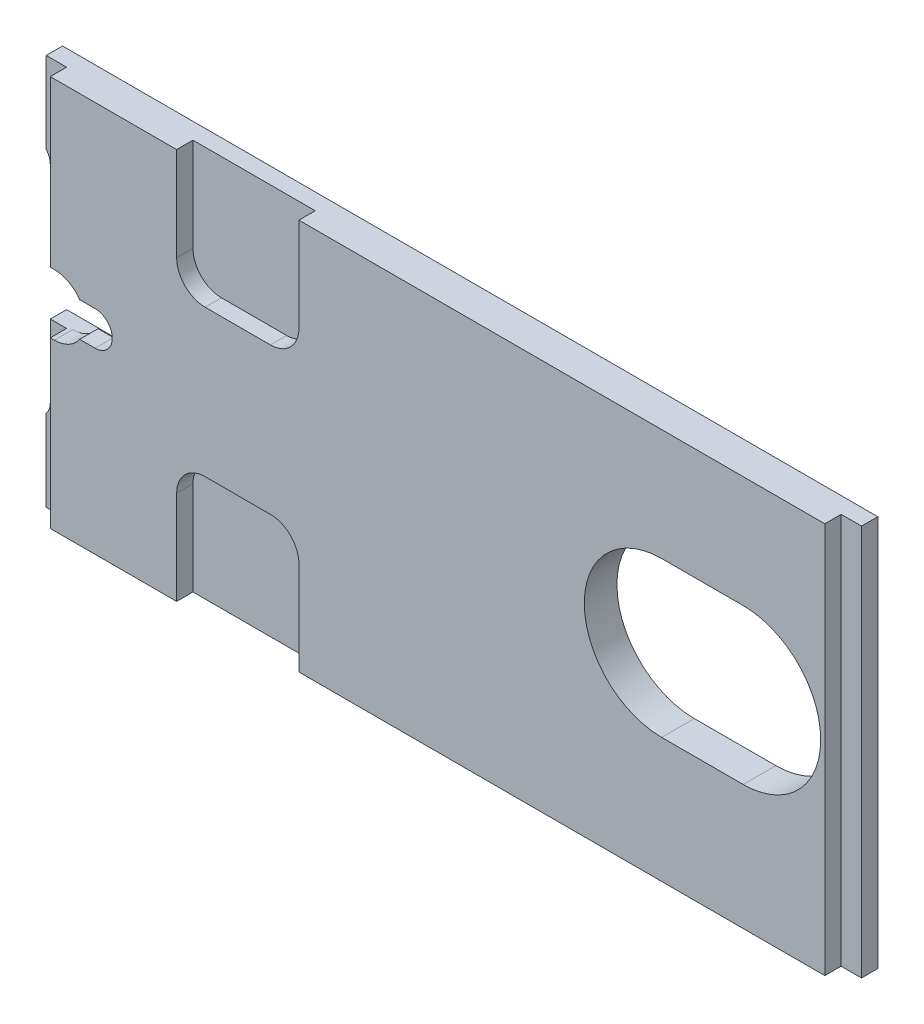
ISO-10303-21;
HEADER;
FILE_DESCRIPTION(('STEP AP214'),'2;1');
FILE_NAME('part.step','',(''),(''),'','','');
FILE_SCHEMA(('AUTOMOTIVE_DESIGN { 1 0 10303 214 1 1 1 1 }'));
ENDSEC;
DATA;
#1=APPLICATION_CONTEXT('core data for automotive mechanical design processes');
#2=APPLICATION_PROTOCOL_DEFINITION('international standard','automotive_design',2000,#1);
#3=PRODUCT_CONTEXT('',#1,'mechanical');
#4=PRODUCT('Part','Part','',(#3));
#5=PRODUCT_RELATED_PRODUCT_CATEGORY('part','',(#4));
#6=PRODUCT_DEFINITION_FORMATION('','',#4);
#7=PRODUCT_DEFINITION_CONTEXT('part definition',#1,'design');
#8=PRODUCT_DEFINITION('design','',#6,#7);
#9=PRODUCT_DEFINITION_SHAPE('','',#8);
#10=(LENGTH_UNIT() NAMED_UNIT(*) SI_UNIT(.MILLI.,.METRE.));
#11=(NAMED_UNIT(*) PLANE_ANGLE_UNIT() SI_UNIT($,.RADIAN.));
#12=(NAMED_UNIT(*) SI_UNIT($,.STERADIAN.) SOLID_ANGLE_UNIT());
#13=UNCERTAINTY_MEASURE_WITH_UNIT(LENGTH_MEASURE(1.E-05),#10,'distance_accuracy_value','');
#14=(GEOMETRIC_REPRESENTATION_CONTEXT(3) GLOBAL_UNCERTAINTY_ASSIGNED_CONTEXT((#13)) GLOBAL_UNIT_ASSIGNED_CONTEXT((#10,
#11,#12)) REPRESENTATION_CONTEXT('',''));
#15=CARTESIAN_POINT('',(0.,0.,0.));
#16=DIRECTION('',(0.,0.,1.));
#17=DIRECTION('',(1.,0.,0.));
#18=AXIS2_PLACEMENT_3D('',#15,#16,#17);
#19=CARTESIAN_POINT('',(-19.,25.354248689,0.));
#20=DIRECTION('',(0.,0.,1.));
#21=DIRECTION('',(1.,0.,0.));
#22=AXIS2_PLACEMENT_3D('',#19,#20,#21);
#23=CYLINDRICAL_SURFACE('',#22,4.);
#24=DIRECTION('',(0.,0.,1.));
#25=VECTOR('',#24,1.);
#26=CARTESIAN_POINT('',(-15.,25.354248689,2.));
#27=LINE('',#26,#25);
#28=CARTESIAN_POINT('',(-14.999999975,25.354248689,0.));
#29=VERTEX_POINT('',#28);
#30=CARTESIAN_POINT('',(-15.,25.354248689,4.));
#31=VERTEX_POINT('',#30);
#32=EDGE_CURVE('E621',#29,#31,#27,.T.);
#33=ORIENTED_EDGE('',*,*,#32,.T.);
#34=CARTESIAN_POINT('',(-19.,25.354248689,4.));
#35=DIRECTION('',(0.,0.,1.));
#36=DIRECTION('',(1.,0.,0.));
#37=AXIS2_PLACEMENT_3D('',#34,#35,#36);
#38=CIRCLE('',#37,4.);
#39=CARTESIAN_POINT('',(-16.,28.0000000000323,4.));
#40=VERTEX_POINT('',#39);
#41=EDGE_CURVE('E339',#31,#40,#38,.T.);
#42=ORIENTED_EDGE('',*,*,#41,.T.);
#43=DIRECTION('',(0.,0.,-1.));
#44=VECTOR('',#43,1.);
#45=CARTESIAN_POINT('',(-16.,28.,2.));
#46=LINE('',#45,#44);
#47=CARTESIAN_POINT('',(-16.,28.0000000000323,0.));
#48=VERTEX_POINT('',#47);
#49=EDGE_CURVE('E326',#40,#48,#46,.T.);
#50=ORIENTED_EDGE('',*,*,#49,.T.);
#51=CARTESIAN_POINT('',(-19.,25.354248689,0.));
#52=DIRECTION('',(0.,0.,1.));
#53=DIRECTION('',(1.,0.,0.));
#54=AXIS2_PLACEMENT_3D('',#51,#52,#53);
#55=CIRCLE('',#54,4.);
#56=EDGE_CURVE('E338',#29,#48,#55,.T.);
#57=ORIENTED_EDGE('',*,*,#56,.F.);
#58=EDGE_LOOP('',(#33,#42,#50,#57));
#59=FACE_BOUND('',#58,.T.);
#60=ADVANCED_FACE('F14',(#59),#23,.F.);
#61=CARTESIAN_POINT('',(-19.,-25.354248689,0.));
#62=DIRECTION('',(0.,0.,1.));
#63=DIRECTION('',(1.,0.,0.));
#64=AXIS2_PLACEMENT_3D('',#61,#62,#63);
#65=CYLINDRICAL_SURFACE('',#64,4.);
#66=DIRECTION('',(0.,0.,1.));
#67=VECTOR('',#66,1.);
#68=CARTESIAN_POINT('',(-16.,-28.,2.));
#69=LINE('',#68,#67);
#70=CARTESIAN_POINT('',(-16.,-28.0000000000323,0.));
#71=VERTEX_POINT('',#70);
#72=CARTESIAN_POINT('',(-16.,-28.0000000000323,4.));
#73=VERTEX_POINT('',#72);
#74=EDGE_CURVE('E333',#71,#73,#69,.T.);
#75=ORIENTED_EDGE('',*,*,#74,.T.);
#76=CARTESIAN_POINT('',(-19.,-25.354248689,4.));
#77=DIRECTION('',(0.,0.,1.));
#78=DIRECTION('',(1.,0.,0.));
#79=AXIS2_PLACEMENT_3D('',#76,#77,#78);
#80=CIRCLE('',#79,4.);
#81=CARTESIAN_POINT('',(-15.,-25.354248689,4.));
#82=VERTEX_POINT('',#81);
#83=EDGE_CURVE('E327',#73,#82,#80,.T.);
#84=ORIENTED_EDGE('',*,*,#83,.T.);
#85=DIRECTION('',(0.,0.,-1.));
#86=VECTOR('',#85,1.);
#87=CARTESIAN_POINT('',(-15.,-25.354248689,2.));
#88=LINE('',#87,#86);
#89=CARTESIAN_POINT('',(-14.999999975,-25.354248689,0.));
#90=VERTEX_POINT('',#89);
#91=EDGE_CURVE('E322',#82,#90,#88,.T.);
#92=ORIENTED_EDGE('',*,*,#91,.T.);
#93=CARTESIAN_POINT('',(-19.,-25.354248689,0.));
#94=DIRECTION('',(0.,0.,1.));
#95=DIRECTION('',(1.,0.,0.));
#96=AXIS2_PLACEMENT_3D('',#93,#94,#95);
#97=CIRCLE('',#96,4.);
#98=EDGE_CURVE('E356',#71,#90,#97,.T.);
#99=ORIENTED_EDGE('',*,*,#98,.F.);
#100=EDGE_LOOP('',(#75,#84,#92,#99));
#101=FACE_BOUND('',#100,.T.);
#102=ADVANCED_FACE('F741',(#101),#65,.F.);
#103=CARTESIAN_POINT('',(-15.,-7.5,4.));
#104=DIRECTION('',(1.,0.,0.));
#105=DIRECTION('',(0.,-1.,0.));
#106=AXIS2_PLACEMENT_3D('',#103,#104,#105);
#107=PLANE('',#106);
#108=ORIENTED_EDGE('',*,*,#91,.F.);
#109=DIRECTION('',(0.,1.,0.));
#110=VECTOR('',#109,1.);
#111=CARTESIAN_POINT('',(-15.,-27.75,4.));
#112=LINE('',#111,#110);
#113=CARTESIAN_POINT('',(-15.,-7.5,4.));
#114=VERTEX_POINT('',#113);
#115=EDGE_CURVE('E324',#82,#114,#112,.T.);
#116=ORIENTED_EDGE('',*,*,#115,.T.);
#117=DIRECTION('',(0.,0.,-1.));
#118=VECTOR('',#117,1.);
#119=CARTESIAN_POINT('',(-15.,-7.5,4.));
#120=LINE('',#119,#118);
#121=CARTESIAN_POINT('',(-14.9999999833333,-7.5,0.));
#122=VERTEX_POINT('',#121);
#123=EDGE_CURVE('E657',#114,#122,#120,.T.);
#124=ORIENTED_EDGE('',*,*,#123,.T.);
#125=DIRECTION('',(0.,1.,0.));
#126=VECTOR('',#125,1.);
#127=CARTESIAN_POINT('',(-14.99999995,0.,0.));
#128=LINE('',#127,#126);
#129=EDGE_CURVE('E351',#90,#122,#128,.T.);
#130=ORIENTED_EDGE('',*,*,#129,.F.);
#131=EDGE_LOOP('',(#108,#116,#124,#130));
#132=FACE_BOUND('',#131,.T.);
#133=ADVANCED_FACE('F744',(#132),#107,.F.);
#134=CARTESIAN_POINT('',(-15.,25.354248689,4.));
#135=DIRECTION('',(1.,0.,0.));
#136=DIRECTION('',(0.,-1.,0.));
#137=AXIS2_PLACEMENT_3D('',#134,#135,#136);
#138=PLANE('',#137);
#139=ORIENTED_EDGE('',*,*,#32,.F.);
#140=DIRECTION('',(0.,1.,0.));
#141=VECTOR('',#140,1.);
#142=CARTESIAN_POINT('',(-14.99999995,0.,0.));
#143=LINE('',#142,#141);
#144=CARTESIAN_POINT('',(-14.9999999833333,7.5,0.));
#145=VERTEX_POINT('',#144);
#146=EDGE_CURVE('E347',#145,#29,#143,.T.);
#147=ORIENTED_EDGE('',*,*,#146,.F.);
#148=DIRECTION('',(0.,0.,1.));
#149=VECTOR('',#148,1.);
#150=CARTESIAN_POINT('',(-15.,7.5,4.));
#151=LINE('',#150,#149);
#152=CARTESIAN_POINT('',(-15.,7.5,4.));
#153=VERTEX_POINT('',#152);
#154=EDGE_CURVE('E667',#145,#153,#151,.T.);
#155=ORIENTED_EDGE('',*,*,#154,.T.);
#156=DIRECTION('',(0.,1.,0.));
#157=VECTOR('',#156,1.);
#158=CARTESIAN_POINT('',(-15.,27.75,4.));
#159=LINE('',#158,#157);
#160=EDGE_CURVE('E342',#153,#31,#159,.T.);
#161=ORIENTED_EDGE('',*,*,#160,.T.);
#162=EDGE_LOOP('',(#139,#147,#155,#161));
#163=FACE_BOUND('',#162,.T.);
#164=ADVANCED_FACE('F638',(#163),#138,.F.);
#165=CARTESIAN_POINT('',(-16.,-48.,4.));
#166=DIRECTION('',(1.,0.,0.));
#167=DIRECTION('',(0.,0.,-1.));
#168=AXIS2_PLACEMENT_3D('',#165,#166,#167);
#169=PLANE('',#168);
#170=ORIENTED_EDGE('',*,*,#74,.F.);
#171=DIRECTION('',(0.,1.,0.));
#172=VECTOR('',#171,1.);
#173=CARTESIAN_POINT('',(-16.,0.,0.));
#174=LINE('',#173,#172);
#175=CARTESIAN_POINT('',(-16.,-48.,0.));
#176=VERTEX_POINT('',#175);
#177=EDGE_CURVE('E359',#176,#71,#174,.T.);
#178=ORIENTED_EDGE('',*,*,#177,.F.);
#179=DIRECTION('',(0.,0.,1.));
#180=VECTOR('',#179,1.);
#181=CARTESIAN_POINT('',(-16.,-48.,4.));
#182=LINE('',#181,#180);
#183=CARTESIAN_POINT('',(-16.,-48.,4.));
#184=VERTEX_POINT('',#183);
#185=EDGE_CURVE('E571',#176,#184,#182,.T.);
#186=ORIENTED_EDGE('',*,*,#185,.T.);
#187=DIRECTION('',(0.,1.,0.));
#188=VECTOR('',#187,1.);
#189=CARTESIAN_POINT('',(-16.,-27.75,4.));
#190=LINE('',#189,#188);
#191=EDGE_CURVE('E330',#184,#73,#190,.T.);
#192=ORIENTED_EDGE('',*,*,#191,.T.);
#193=EDGE_LOOP('',(#170,#178,#186,#192));
#194=FACE_BOUND('',#193,.T.);
#195=ADVANCED_FACE('F728',(#194),#169,.F.);
#196=CARTESIAN_POINT('',(20.,-48.,4.));
#197=DIRECTION('',(0.,0.,-1.));
#198=DIRECTION('',(0.,1.,0.));
#199=AXIS2_PLACEMENT_3D('',#196,#197,#198);
#200=PLANE('',#199);
#201=DIRECTION('',(0.,1.,0.));
#202=VECTOR('',#201,1.);
#203=CARTESIAN_POINT('',(50.,-36.5,4.));
#204=LINE('',#203,#202);
#205=CARTESIAN_POINT('',(49.9999999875,-48.,4.));
#206=VERTEX_POINT('',#205);
#207=CARTESIAN_POINT('',(50.,-24.9999999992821,4.));
#208=VERTEX_POINT('',#207);
#209=EDGE_CURVE('E607',#206,#208,#204,.T.);
#210=ORIENTED_EDGE('',*,*,#209,.T.);
#211=CARTESIAN_POINT('',(43.,-25.,4.));
#212=DIRECTION('',(0.,0.,1.));
#213=DIRECTION('',(1.,0.,0.));
#214=AXIS2_PLACEMENT_3D('',#211,#212,#213);
#215=CIRCLE('',#214,7.);
#216=CARTESIAN_POINT('',(43.,-18.,4.));
#217=VERTEX_POINT('',#216);
#218=EDGE_CURVE('E498',#217,#208,#215,.F.);
#219=ORIENTED_EDGE('',*,*,#218,.F.);
#220=DIRECTION('',(-1.,0.,0.));
#221=VECTOR('',#220,1.);
#222=CARTESIAN_POINT('',(35.,-18.,4.));
#223=LINE('',#222,#221);
#224=CARTESIAN_POINT('',(26.9999999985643,-18.,4.));
#225=VERTEX_POINT('',#224);
#226=EDGE_CURVE('E495',#217,#225,#223,.T.);
#227=ORIENTED_EDGE('',*,*,#226,.T.);
#228=CARTESIAN_POINT('',(27.,-25.,4.));
#229=DIRECTION('',(0.,0.,1.));
#230=DIRECTION('',(1.,0.,0.));
#231=AXIS2_PLACEMENT_3D('',#228,#229,#230);
#232=CIRCLE('',#231,7.);
#233=CARTESIAN_POINT('',(20.,-25.,4.));
#234=VERTEX_POINT('',#233);
#235=EDGE_CURVE('E491',#234,#225,#232,.F.);
#236=ORIENTED_EDGE('',*,*,#235,.F.);
#237=DIRECTION('',(0.,-1.,0.));
#238=VECTOR('',#237,1.);
#239=CARTESIAN_POINT('',(20.,-36.5,4.));
#240=LINE('',#239,#238);
#241=CARTESIAN_POINT('',(20.000000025,-48.,4.));
#242=VERTEX_POINT('',#241);
#243=EDGE_CURVE('E476',#234,#242,#240,.T.);
#244=ORIENTED_EDGE('',*,*,#243,.T.);
#245=DIRECTION('',(1.,0.,0.));
#246=VECTOR('',#245,1.);
#247=CARTESIAN_POINT('',(71.5,-48.,4.));
#248=LINE('',#247,#246);
#249=EDGE_CURVE('E481',#242,#206,#248,.T.);
#250=ORIENTED_EDGE('',*,*,#249,.T.);
#251=EDGE_LOOP('',(#210,#219,#227,#236,#244,#250));
#252=FACE_BOUND('',#251,.T.);
#253=ADVANCED_FACE('F1028',(#252),#200,.F.);
#254=CARTESIAN_POINT('',(-16.,-48.,4.));
#255=DIRECTION('',(0.,0.,-1.));
#256=DIRECTION('',(0.,1.,0.));
#257=AXIS2_PLACEMENT_3D('',#254,#255,#256);
#258=PLANE('',#257);
#259=ORIENTED_EDGE('',*,*,#115,.F.);
#260=ORIENTED_EDGE('',*,*,#83,.F.);
#261=ORIENTED_EDGE('',*,*,#191,.F.);
#262=DIRECTION('',(1.,0.,0.));
#263=VECTOR('',#262,1.);
#264=CARTESIAN_POINT('',(71.5,-48.,4.));
#265=LINE('',#264,#263);
#266=CARTESIAN_POINT('',(-10.9999999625,-48.,4.));
#267=VERTEX_POINT('',#266);
#268=EDGE_CURVE('E482',#184,#267,#265,.T.);
#269=ORIENTED_EDGE('',*,*,#268,.T.);
#270=DIRECTION('',(0.,1.,0.));
#271=VECTOR('',#270,1.);
#272=CARTESIAN_POINT('',(-11.,-27.75,4.));
#273=LINE('',#272,#271);
#274=CARTESIAN_POINT('',(-10.9999999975,-7.5,4.));
#275=VERTEX_POINT('',#274);
#276=EDGE_CURVE('E372',#267,#275,#273,.T.);
#277=ORIENTED_EDGE('',*,*,#276,.T.);
#278=DIRECTION('',(-1.,0.,0.));
#279=VECTOR('',#278,1.);
#280=CARTESIAN_POINT('',(-7.5,-7.5,4.));
#281=LINE('',#280,#279);
#282=EDGE_CURVE('E537',#275,#114,#281,.T.);
#283=ORIENTED_EDGE('',*,*,#282,.T.);
#284=EDGE_LOOP('',(#259,#260,#261,#269,#277,#283));
#285=FACE_BOUND('',#284,.T.);
#286=ADVANCED_FACE('F736',(#285),#258,.F.);
#287=CARTESIAN_POINT('',(-16.,28.,4.));
#288=DIRECTION('',(1.,0.,0.));
#289=DIRECTION('',(0.,0.,-1.));
#290=AXIS2_PLACEMENT_3D('',#287,#288,#289);
#291=PLANE('',#290);
#292=ORIENTED_EDGE('',*,*,#49,.F.);
#293=DIRECTION('',(0.,1.,0.));
#294=VECTOR('',#293,1.);
#295=CARTESIAN_POINT('',(-16.,27.75,4.));
#296=LINE('',#295,#294);
#297=CARTESIAN_POINT('',(-16.,48.,4.));
#298=VERTEX_POINT('',#297);
#299=EDGE_CURVE('E336',#40,#298,#296,.T.);
#300=ORIENTED_EDGE('',*,*,#299,.T.);
#301=DIRECTION('',(0.,0.,1.));
#302=VECTOR('',#301,1.);
#303=CARTESIAN_POINT('',(-16.,48.,4.));
#304=LINE('',#303,#302);
#305=CARTESIAN_POINT('',(-16.,48.,0.));
#306=VERTEX_POINT('',#305);
#307=EDGE_CURVE('E555',#306,#298,#304,.T.);
#308=ORIENTED_EDGE('',*,*,#307,.F.);
#309=DIRECTION('',(0.,1.,0.));
#310=VECTOR('',#309,1.);
#311=CARTESIAN_POINT('',(-16.,0.,0.));
#312=LINE('',#311,#310);
#313=EDGE_CURVE('E362',#48,#306,#312,.T.);
#314=ORIENTED_EDGE('',*,*,#313,.F.);
#315=EDGE_LOOP('',(#292,#300,#308,#314));
#316=FACE_BOUND('',#315,.T.);
#317=ADVANCED_FACE('F626',(#316),#291,.F.);
#318=CARTESIAN_POINT('',(-16.,7.5,4.));
#319=DIRECTION('',(0.,0.,-1.));
#320=DIRECTION('',(0.,1.,0.));
#321=AXIS2_PLACEMENT_3D('',#318,#319,#320);
#322=PLANE('',#321);
#323=ORIENTED_EDGE('',*,*,#41,.F.);
#324=ORIENTED_EDGE('',*,*,#160,.F.);
#325=DIRECTION('',(1.,0.,0.));
#326=VECTOR('',#325,1.);
#327=CARTESIAN_POINT('',(-7.5,7.5,4.));
#328=LINE('',#327,#326);
#329=CARTESIAN_POINT('',(-10.9999999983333,7.5,4.));
#330=VERTEX_POINT('',#329);
#331=EDGE_CURVE('E545',#153,#330,#328,.T.);
#332=ORIENTED_EDGE('',*,*,#331,.T.);
#333=DIRECTION('',(0.,1.,0.));
#334=VECTOR('',#333,1.);
#335=CARTESIAN_POINT('',(-11.,27.75,4.));
#336=LINE('',#335,#334);
#337=CARTESIAN_POINT('',(-10.99999995,48.,4.));
#338=VERTEX_POINT('',#337);
#339=EDGE_CURVE('E465',#330,#338,#336,.T.);
#340=ORIENTED_EDGE('',*,*,#339,.T.);
#341=DIRECTION('',(1.,0.,0.));
#342=VECTOR('',#341,1.);
#343=CARTESIAN_POINT('',(71.5,48.,4.));
#344=LINE('',#343,#342);
#345=EDGE_CURVE('E455',#298,#338,#344,.T.);
#346=ORIENTED_EDGE('',*,*,#345,.F.);
#347=ORIENTED_EDGE('',*,*,#299,.F.);
#348=EDGE_LOOP('',(#323,#324,#332,#340,#346,#347));
#349=FACE_BOUND('',#348,.T.);
#350=ADVANCED_FACE('F629',(#349),#322,.F.);
#351=CARTESIAN_POINT('',(20.,48.,4.));
#352=DIRECTION('',(0.,0.,1.));
#353=DIRECTION('',(0.,-1.,0.));
#354=AXIS2_PLACEMENT_3D('',#351,#352,#353);
#355=PLANE('',#354);
#356=DIRECTION('',(1.,0.,0.));
#357=VECTOR('',#356,1.);
#358=CARTESIAN_POINT('',(71.5,48.,4.));
#359=LINE('',#358,#357);
#360=CARTESIAN_POINT('',(20.0000000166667,48.,4.));
#361=VERTEX_POINT('',#360);
#362=CARTESIAN_POINT('',(49.9999999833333,48.,4.));
#363=VERTEX_POINT('',#362);
#364=EDGE_CURVE('E513',#361,#363,#359,.T.);
#365=ORIENTED_EDGE('',*,*,#364,.F.);
#366=DIRECTION('',(0.,-1.,0.));
#367=VECTOR('',#366,1.);
#368=CARTESIAN_POINT('',(20.,36.5,4.));
#369=LINE('',#368,#367);
#370=CARTESIAN_POINT('',(20.,25.0000000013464,4.));
#371=VERTEX_POINT('',#370);
#372=EDGE_CURVE('E442',#361,#371,#369,.T.);
#373=ORIENTED_EDGE('',*,*,#372,.T.);
#374=CARTESIAN_POINT('',(27.,25.,4.));
#375=DIRECTION('',(0.,0.,1.));
#376=DIRECTION('',(1.,0.,0.));
#377=AXIS2_PLACEMENT_3D('',#374,#375,#376);
#378=CIRCLE('',#377,7.);
#379=CARTESIAN_POINT('',(26.9999999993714,18.,4.));
#380=VERTEX_POINT('',#379);
#381=EDGE_CURVE('E438',#380,#371,#378,.F.);
#382=ORIENTED_EDGE('',*,*,#381,.F.);
#383=DIRECTION('',(1.,0.,0.));
#384=VECTOR('',#383,1.);
#385=CARTESIAN_POINT('',(35.,18.,4.));
#386=LINE('',#385,#384);
#387=CARTESIAN_POINT('',(43.,18.,4.));
#388=VERTEX_POINT('',#387);
#389=EDGE_CURVE('E543',#380,#388,#386,.T.);
#390=ORIENTED_EDGE('',*,*,#389,.T.);
#391=CARTESIAN_POINT('',(43.,25.,4.));
#392=DIRECTION('',(0.,0.,1.));
#393=DIRECTION('',(1.,0.,0.));
#394=AXIS2_PLACEMENT_3D('',#391,#392,#393);
#395=CIRCLE('',#394,7.);
#396=CARTESIAN_POINT('',(50.,25.,4.));
#397=VERTEX_POINT('',#396);
#398=EDGE_CURVE('E523',#397,#388,#395,.F.);
#399=ORIENTED_EDGE('',*,*,#398,.F.);
#400=DIRECTION('',(0.,1.,0.));
#401=VECTOR('',#400,1.);
#402=CARTESIAN_POINT('',(50.,36.5,4.));
#403=LINE('',#402,#401);
#404=EDGE_CURVE('E519',#397,#363,#403,.T.);
#405=ORIENTED_EDGE('',*,*,#404,.T.);
#406=EDGE_LOOP('',(#365,#373,#382,#390,#399,#405));
#407=FACE_BOUND('',#406,.T.);
#408=ADVANCED_FACE('F710',(#407),#355,.T.);
#409=CARTESIAN_POINT('',(-16.,-48.,0.));
#410=DIRECTION('',(0.,0.,-1.));
#411=DIRECTION('',(0.,1.,0.));
#412=AXIS2_PLACEMENT_3D('',#409,#410,#411);
#413=PLANE('',#412);
#414=CARTESIAN_POINT('',(159.,1.60748590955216,0.));
#415=DIRECTION('',(0.,0.,-1.));
#416=DIRECTION('',(-1.,0.,0.));
#417=AXIS2_PLACEMENT_3D('',#414,#415,#416);
#418=CIRCLE('',#417,19.);
#419=CARTESIAN_POINT('',(159.,20.6074859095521,0.));
#420=VERTEX_POINT('',#419);
#421=CARTESIAN_POINT('',(159.,-17.3925140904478,0.));
#422=VERTEX_POINT('',#421);
#423=EDGE_CURVE('E38',#420,#422,#418,.T.);
#424=ORIENTED_EDGE('',*,*,#423,.F.);
#425=DIRECTION('',(1.,0.,0.));
#426=VECTOR('',#425,1.);
#427=CARTESIAN_POINT('',(159.,20.6074859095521,0.));
#428=LINE('',#427,#426);
#429=CARTESIAN_POINT('',(139.,20.6074859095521,0.));
#430=VERTEX_POINT('',#429);
#431=EDGE_CURVE('E305',#430,#420,#428,.T.);
#432=ORIENTED_EDGE('',*,*,#431,.F.);
#433=CARTESIAN_POINT('',(139.,1.60748590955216,0.));
#434=DIRECTION('',(0.,0.,-1.));
#435=DIRECTION('',(-1.,0.,0.));
#436=AXIS2_PLACEMENT_3D('',#433,#434,#435);
#437=CIRCLE('',#436,19.);
#438=CARTESIAN_POINT('',(139.,-17.3925140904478,0.));
#439=VERTEX_POINT('',#438);
#440=EDGE_CURVE('E302',#439,#430,#437,.T.);
#441=ORIENTED_EDGE('',*,*,#440,.F.);
#442=DIRECTION('',(-1.,0.,0.));
#443=VECTOR('',#442,1.);
#444=CARTESIAN_POINT('',(139.,-17.3925140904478,0.));
#445=LINE('',#444,#443);
#446=EDGE_CURVE('E299',#422,#439,#445,.T.);
#447=ORIENTED_EDGE('',*,*,#446,.F.);
#448=EDGE_LOOP('',(#424,#432,#441,#447));
#449=FACE_BOUND('',#448,.T.);
#450=ORIENTED_EDGE('',*,*,#313,.T.);
#451=DIRECTION('',(-1.,0.,0.));
#452=VECTOR('',#451,1.);
#453=CARTESIAN_POINT('',(71.5,48.,0.));
#454=LINE('',#453,#452);
#455=CARTESIAN_POINT('',(184.,48.,0.));
#456=VERTEX_POINT('',#455);
#457=EDGE_CURVE('E512',#456,#306,#454,.T.);
#458=ORIENTED_EDGE('',*,*,#457,.F.);
#459=DIRECTION('',(0.,-1.,0.));
#460=VECTOR('',#459,1.);
#461=CARTESIAN_POINT('',(184.,48.,0.));
#462=LINE('',#461,#460);
#463=CARTESIAN_POINT('',(184.,-48.,0.));
#464=VERTEX_POINT('',#463);
#465=EDGE_CURVE('E311',#456,#464,#462,.T.);
#466=ORIENTED_EDGE('',*,*,#465,.T.);
#467=DIRECTION('',(-1.,0.,0.));
#468=VECTOR('',#467,1.);
#469=CARTESIAN_POINT('',(71.5,-48.,0.));
#470=LINE('',#469,#468);
#471=EDGE_CURVE('E504',#464,#176,#470,.T.);
#472=ORIENTED_EDGE('',*,*,#471,.T.);
#473=ORIENTED_EDGE('',*,*,#177,.T.);
#474=ORIENTED_EDGE('',*,*,#98,.T.);
#475=ORIENTED_EDGE('',*,*,#129,.T.);
#476=DIRECTION('',(1.,0.,0.));
#477=VECTOR('',#476,1.);
#478=CARTESIAN_POINT('',(-7.5,-7.5,0.));
#479=LINE('',#478,#477);
#480=CARTESIAN_POINT('',(-1.53825216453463E-09,-7.5,0.));
#481=VERTEX_POINT('',#480);
#482=EDGE_CURVE('E612',#122,#481,#479,.T.);
#483=ORIENTED_EDGE('',*,*,#482,.T.);
#484=CARTESIAN_POINT('',(0.,0.,0.));
#485=DIRECTION('',(0.,0.,-1.));
#486=DIRECTION('',(-1.,0.,0.));
#487=AXIS2_PLACEMENT_3D('',#484,#485,#486);
#488=CIRCLE('',#487,7.5);
#489=CARTESIAN_POINT('',(0.,7.5,0.));
#490=VERTEX_POINT('',#489);
#491=EDGE_CURVE('E535',#490,#481,#488,.T.);
#492=ORIENTED_EDGE('',*,*,#491,.F.);
#493=DIRECTION('',(-1.,0.,0.));
#494=VECTOR('',#493,1.);
#495=CARTESIAN_POINT('',(-7.5,7.5,0.));
#496=LINE('',#495,#494);
#497=EDGE_CURVE('E532',#490,#145,#496,.T.);
#498=ORIENTED_EDGE('',*,*,#497,.T.);
#499=ORIENTED_EDGE('',*,*,#146,.T.);
#500=ORIENTED_EDGE('',*,*,#56,.T.);
#501=EDGE_LOOP('',(#450,#458,#466,#472,#473,#474,#475,#483,#492,#498,#499,#500));
#502=FACE_BOUND('',#501,.T.);
#503=ADVANCED_FACE('F635',(#449,#502),#413,.T.);
#504=CARTESIAN_POINT('',(-15.,-7.5,8.));
#505=DIRECTION('',(0.,-1.,0.));
#506=DIRECTION('',(0.,0.,-1.));
#507=AXIS2_PLACEMENT_3D('',#504,#505,#506);
#508=PLANE('',#507);
#509=ORIENTED_EDGE('',*,*,#123,.F.);
#510=ORIENTED_EDGE('',*,*,#282,.F.);
#511=DIRECTION('',(0.,0.,1.));
#512=VECTOR('',#511,1.);
#513=CARTESIAN_POINT('',(-11.,-7.5,6.));
#514=LINE('',#513,#512);
#515=CARTESIAN_POINT('',(-10.9999999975,-7.5,8.));
#516=VERTEX_POINT('',#515);
#517=EDGE_CURVE('E373',#275,#516,#514,.T.);
#518=ORIENTED_EDGE('',*,*,#517,.T.);
#519=DIRECTION('',(-1.,0.,0.));
#520=VECTOR('',#519,1.);
#521=CARTESIAN_POINT('',(-7.5,-7.5,8.));
#522=LINE('',#521,#520);
#523=CARTESIAN_POINT('',(-10.0000000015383,-7.5,8.));
#524=VERTEX_POINT('',#523);
#525=EDGE_CURVE('E350',#524,#516,#522,.T.);
#526=ORIENTED_EDGE('',*,*,#525,.F.);
#527=DIRECTION('',(0.,0.,-1.));
#528=VECTOR('',#527,1.);
#529=CARTESIAN_POINT('',(-10.0000000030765,-7.5,5.75));
#530=LINE('',#529,#528);
#531=CARTESIAN_POINT('',(-10.0000000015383,-7.5,3.5));
#532=VERTEX_POINT('',#531);
#533=EDGE_CURVE('E381',#532,#524,#530,.F.);
#534=ORIENTED_EDGE('',*,*,#533,.F.);
#535=DIRECTION('',(1.,0.,0.));
#536=VECTOR('',#535,1.);
#537=CARTESIAN_POINT('',(-1.25,-7.5,3.5));
#538=LINE('',#537,#536);
#539=CARTESIAN_POINT('',(-1.53825216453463E-09,-7.5,3.5));
#540=VERTEX_POINT('',#539);
#541=EDGE_CURVE('E379',#532,#540,#538,.T.);
#542=ORIENTED_EDGE('',*,*,#541,.T.);
#543=DIRECTION('',(0.,0.,-1.));
#544=VECTOR('',#543,1.);
#545=CARTESIAN_POINT('',(-3.07654943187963E-09,-7.5,1.75));
#546=LINE('',#545,#544);
#547=EDGE_CURVE('E527',#481,#540,#546,.F.);
#548=ORIENTED_EDGE('',*,*,#547,.F.);
#549=ORIENTED_EDGE('',*,*,#482,.F.);
#550=EDGE_LOOP('',(#509,#510,#518,#526,#534,#542,#548,#549));
#551=FACE_BOUND('',#550,.T.);
#552=ADVANCED_FACE('F749',(#551),#508,.F.);
#553=CARTESIAN_POINT('',(0.,0.,3.5));
#554=DIRECTION('',(0.,0.,-1.));
#555=DIRECTION('',(-1.,0.,0.));
#556=AXIS2_PLACEMENT_3D('',#553,#554,#555);
#557=CYLINDRICAL_SURFACE('',#556,7.5);
#558=ORIENTED_EDGE('',*,*,#547,.T.);
#559=CARTESIAN_POINT('',(0.,0.,3.5));
#560=DIRECTION('',(0.,0.,-1.));
#561=DIRECTION('',(-1.,0.,0.));
#562=AXIS2_PLACEMENT_3D('',#559,#560,#561);
#563=CIRCLE('',#562,7.5);
#564=CARTESIAN_POINT('',(0.,7.5,3.5));
#565=VERTEX_POINT('',#564);
#566=EDGE_CURVE('E378',#540,#565,#563,.F.);
#567=ORIENTED_EDGE('',*,*,#566,.T.);
#568=DIRECTION('',(0.,0.,-1.));
#569=VECTOR('',#568,1.);
#570=CARTESIAN_POINT('',(0.,7.5,4.));
#571=LINE('',#570,#569);
#572=EDGE_CURVE('E526',#565,#490,#571,.T.);
#573=ORIENTED_EDGE('',*,*,#572,.T.);
#574=ORIENTED_EDGE('',*,*,#491,.T.);
#575=EDGE_LOOP('',(#558,#567,#573,#574));
#576=FACE_BOUND('',#575,.T.);
#577=ADVANCED_FACE('F753',(#576),#557,.F.);
#578=CARTESIAN_POINT('',(-15.,7.5,0.));
#579=DIRECTION('',(0.,1.,0.));
#580=DIRECTION('',(0.,0.,1.));
#581=AXIS2_PLACEMENT_3D('',#578,#579,#580);
#582=PLANE('',#581);
#583=ORIENTED_EDGE('',*,*,#154,.F.);
#584=ORIENTED_EDGE('',*,*,#497,.F.);
#585=ORIENTED_EDGE('',*,*,#572,.F.);
#586=DIRECTION('',(-1.,0.,0.));
#587=VECTOR('',#586,1.);
#588=CARTESIAN_POINT('',(-1.25,7.5,3.5));
#589=LINE('',#588,#587);
#590=CARTESIAN_POINT('',(-10.,7.5,3.5));
#591=VERTEX_POINT('',#590);
#592=EDGE_CURVE('E374',#565,#591,#589,.T.);
#593=ORIENTED_EDGE('',*,*,#592,.T.);
#594=DIRECTION('',(0.,0.,1.));
#595=VECTOR('',#594,1.);
#596=CARTESIAN_POINT('',(-10.,7.5,5.75));
#597=LINE('',#596,#595);
#598=CARTESIAN_POINT('',(-10.,7.5,8.));
#599=VERTEX_POINT('',#598);
#600=EDGE_CURVE('E468',#599,#591,#597,.F.);
#601=ORIENTED_EDGE('',*,*,#600,.F.);
#602=DIRECTION('',(1.,0.,0.));
#603=VECTOR('',#602,1.);
#604=CARTESIAN_POINT('',(-7.5,7.5,8.));
#605=LINE('',#604,#603);
#606=CARTESIAN_POINT('',(-10.9999999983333,7.5,8.));
#607=VERTEX_POINT('',#606);
#608=EDGE_CURVE('E524',#607,#599,#605,.T.);
#609=ORIENTED_EDGE('',*,*,#608,.F.);
#610=DIRECTION('',(0.,0.,-1.));
#611=VECTOR('',#610,1.);
#612=CARTESIAN_POINT('',(-11.,7.5,6.));
#613=LINE('',#612,#611);
#614=EDGE_CURVE('E462',#607,#330,#613,.T.);
#615=ORIENTED_EDGE('',*,*,#614,.T.);
#616=ORIENTED_EDGE('',*,*,#331,.F.);
#617=EDGE_LOOP('',(#583,#584,#585,#593,#601,#609,#615,#616));
#618=FACE_BOUND('',#617,.T.);
#619=ADVANCED_FACE('F689',(#618),#582,.F.);
#620=CARTESIAN_POINT('',(27.,18.,8.));
#621=DIRECTION('',(0.,-1.,0.));
#622=DIRECTION('',(0.,0.,-1.));
#623=AXIS2_PLACEMENT_3D('',#620,#621,#622);
#624=PLANE('',#623);
#625=DIRECTION('',(0.,0.,-1.));
#626=VECTOR('',#625,1.);
#627=CARTESIAN_POINT('',(43.,18.,6.));
#628=LINE('',#627,#626);
#629=CARTESIAN_POINT('',(43.,18.,8.));
#630=VERTEX_POINT('',#629);
#631=EDGE_CURVE('E520',#388,#630,#628,.F.);
#632=ORIENTED_EDGE('',*,*,#631,.F.);
#633=ORIENTED_EDGE('',*,*,#389,.F.);
#634=DIRECTION('',(0.,0.,1.));
#635=VECTOR('',#634,1.);
#636=CARTESIAN_POINT('',(26.9999999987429,18.,6.));
#637=LINE('',#636,#635);
#638=CARTESIAN_POINT('',(26.9999999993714,18.,8.));
#639=VERTEX_POINT('',#638);
#640=EDGE_CURVE('E439',#639,#380,#637,.F.);
#641=ORIENTED_EDGE('',*,*,#640,.F.);
#642=DIRECTION('',(1.,0.,0.));
#643=VECTOR('',#642,1.);
#644=CARTESIAN_POINT('',(71.5,18.,8.));
#645=LINE('',#644,#643);
#646=EDGE_CURVE('E406',#639,#630,#645,.T.);
#647=ORIENTED_EDGE('',*,*,#646,.T.);
#648=EDGE_LOOP('',(#632,#633,#641,#647));
#649=FACE_BOUND('',#648,.T.);
#650=ADVANCED_FACE('F961',(#649),#624,.F.);
#651=CARTESIAN_POINT('',(43.,25.,4.));
#652=DIRECTION('',(0.,0.,1.));
#653=DIRECTION('',(1.,0.,0.));
#654=AXIS2_PLACEMENT_3D('',#651,#652,#653);
#655=CYLINDRICAL_SURFACE('',#654,7.);
#656=ORIENTED_EDGE('',*,*,#398,.T.);
#657=ORIENTED_EDGE('',*,*,#631,.T.);
#658=CARTESIAN_POINT('',(43.,25.,8.));
#659=DIRECTION('',(0.,0.,1.));
#660=DIRECTION('',(1.,0.,0.));
#661=AXIS2_PLACEMENT_3D('',#658,#659,#660);
#662=CIRCLE('',#661,7.);
#663=CARTESIAN_POINT('',(50.000000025,25.,8.));
#664=VERTEX_POINT('',#663);
#665=EDGE_CURVE('E403',#630,#664,#662,.T.);
#666=ORIENTED_EDGE('',*,*,#665,.T.);
#667=DIRECTION('',(0.,0.,-1.));
#668=VECTOR('',#667,1.);
#669=CARTESIAN_POINT('',(50.,25.,6.));
#670=LINE('',#669,#668);
#671=EDGE_CURVE('E516',#664,#397,#670,.T.);
#672=ORIENTED_EDGE('',*,*,#671,.T.);
#673=EDGE_LOOP('',(#656,#657,#666,#672));
#674=FACE_BOUND('',#673,.T.);
#675=ADVANCED_FACE('F953',(#674),#655,.F.);
#676=CARTESIAN_POINT('',(50.,48.,8.));
#677=DIRECTION('',(1.,0.,0.));
#678=DIRECTION('',(0.,-1.,0.));
#679=AXIS2_PLACEMENT_3D('',#676,#677,#678);
#680=PLANE('',#679);
#681=DIRECTION('',(0.,0.,1.));
#682=VECTOR('',#681,1.);
#683=CARTESIAN_POINT('',(49.999999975,48.,4.));
#684=LINE('',#683,#682);
#685=CARTESIAN_POINT('',(50.000000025,48.,8.));
#686=VERTEX_POINT('',#685);
#687=EDGE_CURVE('E510',#363,#686,#684,.T.);
#688=ORIENTED_EDGE('',*,*,#687,.F.);
#689=ORIENTED_EDGE('',*,*,#404,.F.);
#690=ORIENTED_EDGE('',*,*,#671,.F.);
#691=DIRECTION('',(0.,1.,0.));
#692=VECTOR('',#691,1.);
#693=CARTESIAN_POINT('',(50.00000005,0.,8.));
#694=LINE('',#693,#692);
#695=EDGE_CURVE('E401',#664,#686,#694,.T.);
#696=ORIENTED_EDGE('',*,*,#695,.T.);
#697=EDGE_LOOP('',(#688,#689,#690,#696));
#698=FACE_BOUND('',#697,.T.);
#699=ADVANCED_FACE('F944',(#698),#680,.F.);
#700=CARTESIAN_POINT('',(50.,-25.,8.));
#701=DIRECTION('',(1.,0.,0.));
#702=DIRECTION('',(0.,-1.,0.));
#703=AXIS2_PLACEMENT_3D('',#700,#701,#702);
#704=PLANE('',#703);
#705=DIRECTION('',(0.,0.,-1.));
#706=VECTOR('',#705,1.);
#707=CARTESIAN_POINT('',(50.,-24.9999999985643,6.));
#708=LINE('',#707,#706);
#709=CARTESIAN_POINT('',(50.000000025,-24.9999999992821,8.));
#710=VERTEX_POINT('',#709);
#711=EDGE_CURVE('E496',#208,#710,#708,.F.);
#712=ORIENTED_EDGE('',*,*,#711,.F.);
#713=ORIENTED_EDGE('',*,*,#209,.F.);
#714=DIRECTION('',(0.,0.,1.));
#715=VECTOR('',#714,1.);
#716=CARTESIAN_POINT('',(49.999999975,-48.,4.));
#717=LINE('',#716,#715);
#718=CARTESIAN_POINT('',(50.000000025,-48.,8.));
#719=VERTEX_POINT('',#718);
#720=EDGE_CURVE('E501',#206,#719,#717,.T.);
#721=ORIENTED_EDGE('',*,*,#720,.T.);
#722=DIRECTION('',(0.,1.,0.));
#723=VECTOR('',#722,1.);
#724=CARTESIAN_POINT('',(50.00000005,0.,8.));
#725=LINE('',#724,#723);
#726=EDGE_CURVE('E397',#719,#710,#725,.T.);
#727=ORIENTED_EDGE('',*,*,#726,.T.);
#728=EDGE_LOOP('',(#712,#713,#721,#727));
#729=FACE_BOUND('',#728,.T.);
#730=ADVANCED_FACE('F935',(#729),#704,.F.);
#731=CARTESIAN_POINT('',(43.,-25.,4.));
#732=DIRECTION('',(0.,0.,1.));
#733=DIRECTION('',(1.,0.,0.));
#734=AXIS2_PLACEMENT_3D('',#731,#732,#733);
#735=CYLINDRICAL_SURFACE('',#734,7.);
#736=ORIENTED_EDGE('',*,*,#218,.T.);
#737=ORIENTED_EDGE('',*,*,#711,.T.);
#738=CARTESIAN_POINT('',(43.,-25.,8.));
#739=DIRECTION('',(0.,0.,1.));
#740=DIRECTION('',(1.,0.,0.));
#741=AXIS2_PLACEMENT_3D('',#738,#739,#740);
#742=CIRCLE('',#741,7.);
#743=CARTESIAN_POINT('',(43.,-18.,8.));
#744=VERTEX_POINT('',#743);
#745=EDGE_CURVE('E396',#710,#744,#742,.T.);
#746=ORIENTED_EDGE('',*,*,#745,.T.);
#747=DIRECTION('',(0.,0.,-1.));
#748=VECTOR('',#747,1.);
#749=CARTESIAN_POINT('',(43.,-18.,6.));
#750=LINE('',#749,#748);
#751=EDGE_CURVE('E492',#744,#217,#750,.T.);
#752=ORIENTED_EDGE('',*,*,#751,.T.);
#753=EDGE_LOOP('',(#736,#737,#746,#752));
#754=FACE_BOUND('',#753,.T.);
#755=ADVANCED_FACE('F926',(#754),#735,.F.);
#756=CARTESIAN_POINT('',(27.,-18.,4.));
#757=DIRECTION('',(0.,1.,0.));
#758=DIRECTION('',(0.,0.,1.));
#759=AXIS2_PLACEMENT_3D('',#756,#757,#758);
#760=PLANE('',#759);
#761=DIRECTION('',(0.,0.,-1.));
#762=VECTOR('',#761,1.);
#763=CARTESIAN_POINT('',(26.9999999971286,-18.,6.));
#764=LINE('',#763,#762);
#765=CARTESIAN_POINT('',(26.9999999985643,-18.,8.));
#766=VERTEX_POINT('',#765);
#767=EDGE_CURVE('E477',#225,#766,#764,.F.);
#768=ORIENTED_EDGE('',*,*,#767,.F.);
#769=ORIENTED_EDGE('',*,*,#226,.F.);
#770=ORIENTED_EDGE('',*,*,#751,.F.);
#771=DIRECTION('',(-1.,0.,0.));
#772=VECTOR('',#771,1.);
#773=CARTESIAN_POINT('',(71.5,-18.,8.));
#774=LINE('',#773,#772);
#775=EDGE_CURVE('E394',#744,#766,#774,.T.);
#776=ORIENTED_EDGE('',*,*,#775,.T.);
#777=EDGE_LOOP('',(#768,#769,#770,#776));
#778=FACE_BOUND('',#777,.T.);
#779=ADVANCED_FACE('F917',(#778),#760,.F.);
#780=CARTESIAN_POINT('',(27.,-25.,4.));
#781=DIRECTION('',(0.,0.,1.));
#782=DIRECTION('',(1.,0.,0.));
#783=AXIS2_PLACEMENT_3D('',#780,#781,#782);
#784=CYLINDRICAL_SURFACE('',#783,7.);
#785=ORIENTED_EDGE('',*,*,#235,.T.);
#786=ORIENTED_EDGE('',*,*,#767,.T.);
#787=CARTESIAN_POINT('',(27.,-25.,8.));
#788=DIRECTION('',(0.,0.,1.));
#789=DIRECTION('',(1.,0.,0.));
#790=AXIS2_PLACEMENT_3D('',#787,#788,#789);
#791=CIRCLE('',#790,7.);
#792=CARTESIAN_POINT('',(20.00000001,-25.,8.));
#793=VERTEX_POINT('',#792);
#794=EDGE_CURVE('E391',#766,#793,#791,.T.);
#795=ORIENTED_EDGE('',*,*,#794,.T.);
#796=DIRECTION('',(0.,0.,-1.));
#797=VECTOR('',#796,1.);
#798=CARTESIAN_POINT('',(20.,-25.,6.));
#799=LINE('',#798,#797);
#800=EDGE_CURVE('E473',#793,#234,#799,.T.);
#801=ORIENTED_EDGE('',*,*,#800,.T.);
#802=EDGE_LOOP('',(#785,#786,#795,#801));
#803=FACE_BOUND('',#802,.T.);
#804=ADVANCED_FACE('F909',(#803),#784,.F.);
#805=CARTESIAN_POINT('',(20.,-48.,4.));
#806=DIRECTION('',(-1.,0.,0.));
#807=DIRECTION('',(0.,0.,1.));
#808=AXIS2_PLACEMENT_3D('',#805,#806,#807);
#809=PLANE('',#808);
#810=DIRECTION('',(0.,0.,-1.));
#811=VECTOR('',#810,1.);
#812=CARTESIAN_POINT('',(20.00000005,-48.,4.));
#813=LINE('',#812,#811);
#814=CARTESIAN_POINT('',(20.00000003,-48.,8.));
#815=VERTEX_POINT('',#814);
#816=EDGE_CURVE('E478',#815,#242,#813,.T.);
#817=ORIENTED_EDGE('',*,*,#816,.T.);
#818=ORIENTED_EDGE('',*,*,#243,.F.);
#819=ORIENTED_EDGE('',*,*,#800,.F.);
#820=DIRECTION('',(0.,-1.,0.));
#821=VECTOR('',#820,1.);
#822=CARTESIAN_POINT('',(20.00000002,0.,8.));
#823=LINE('',#822,#821);
#824=EDGE_CURVE('E388',#793,#815,#823,.T.);
#825=ORIENTED_EDGE('',*,*,#824,.T.);
#826=EDGE_LOOP('',(#817,#818,#819,#825));
#827=FACE_BOUND('',#826,.T.);
#828=ADVANCED_FACE('F789',(#827),#809,.F.);
#829=CARTESIAN_POINT('',(-16.,-48.,0.));
#830=DIRECTION('',(0.,1.,0.));
#831=DIRECTION('',(0.,0.,1.));
#832=AXIS2_PLACEMENT_3D('',#829,#830,#831);
#833=PLANE('',#832);
#834=DIRECTION('',(0.,0.,-1.));
#835=VECTOR('',#834,1.);
#836=CARTESIAN_POINT('',(184.,-48.,8.));
#837=LINE('',#836,#835);
#838=CARTESIAN_POINT('',(184.,-48.,4.));
#839=VERTEX_POINT('',#838);
#840=EDGE_CURVE('E320',#839,#464,#837,.T.);
#841=ORIENTED_EDGE('',*,*,#840,.F.);
#842=DIRECTION('',(-1.,0.,0.));
#843=VECTOR('',#842,1.);
#844=CARTESIAN_POINT('',(-16.,-48.,4.));
#845=LINE('',#844,#843);
#846=CARTESIAN_POINT('',(179.,-48.,4.));
#847=VERTEX_POINT('',#846);
#848=EDGE_CURVE('E30',#839,#847,#845,.T.);
#849=ORIENTED_EDGE('',*,*,#848,.T.);
#850=DIRECTION('',(0.,0.,1.));
#851=VECTOR('',#850,1.);
#852=CARTESIAN_POINT('',(179.,-48.,0.));
#853=LINE('',#852,#851);
#854=CARTESIAN_POINT('',(179.,-48.,8.));
#855=VERTEX_POINT('',#854);
#856=EDGE_CURVE('E279',#847,#855,#853,.T.);
#857=ORIENTED_EDGE('',*,*,#856,.T.);
#858=DIRECTION('',(-1.,0.,0.));
#859=VECTOR('',#858,1.);
#860=CARTESIAN_POINT('',(71.5,-48.,8.));
#861=LINE('',#860,#859);
#862=EDGE_CURVE('E18',#855,#719,#861,.T.);
#863=ORIENTED_EDGE('',*,*,#862,.T.);
#864=ORIENTED_EDGE('',*,*,#720,.F.);
#865=ORIENTED_EDGE('',*,*,#249,.F.);
#866=ORIENTED_EDGE('',*,*,#816,.F.);
#867=DIRECTION('',(-1.,0.,0.));
#868=VECTOR('',#867,1.);
#869=CARTESIAN_POINT('',(71.5,-48.,8.));
#870=LINE('',#869,#868);
#871=CARTESIAN_POINT('',(-10.9999999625,-48.,8.));
#872=VERTEX_POINT('',#871);
#873=EDGE_CURVE('E390',#815,#872,#870,.T.);
#874=ORIENTED_EDGE('',*,*,#873,.T.);
#875=DIRECTION('',(0.,0.,-1.));
#876=VECTOR('',#875,1.);
#877=CARTESIAN_POINT('',(-11.,-48.,6.));
#878=LINE('',#877,#876);
#879=EDGE_CURVE('E369',#872,#267,#878,.T.);
#880=ORIENTED_EDGE('',*,*,#879,.T.);
#881=ORIENTED_EDGE('',*,*,#268,.F.);
#882=ORIENTED_EDGE('',*,*,#185,.F.);
#883=ORIENTED_EDGE('',*,*,#471,.F.);
#884=EDGE_LOOP('',(#841,#849,#857,#863,#864,#865,#866,#874,#880,#881,#882,#883));
#885=FACE_BOUND('',#884,.T.);
#886=ADVANCED_FACE('F720',(#885),#833,.F.);
#887=CARTESIAN_POINT('',(-11.,-48.,8.));
#888=DIRECTION('',(1.,0.,0.));
#889=DIRECTION('',(0.,0.,-1.));
#890=AXIS2_PLACEMENT_3D('',#887,#888,#889);
#891=PLANE('',#890);
#892=ORIENTED_EDGE('',*,*,#879,.F.);
#893=DIRECTION('',(0.,1.,0.));
#894=VECTOR('',#893,1.);
#895=CARTESIAN_POINT('',(-11.,0.,8.));
#896=LINE('',#895,#894);
#897=EDGE_CURVE('E486',#872,#516,#896,.T.);
#898=ORIENTED_EDGE('',*,*,#897,.T.);
#899=ORIENTED_EDGE('',*,*,#517,.F.);
#900=ORIENTED_EDGE('',*,*,#276,.F.);
#901=EDGE_LOOP('',(#892,#898,#899,#900));
#902=FACE_BOUND('',#901,.T.);
#903=ADVANCED_FACE('F779',(#902),#891,.F.);
#904=CARTESIAN_POINT('',(-11.,7.5,8.));
#905=DIRECTION('',(1.,0.,0.));
#906=DIRECTION('',(0.,0.,-1.));
#907=AXIS2_PLACEMENT_3D('',#904,#905,#906);
#908=PLANE('',#907);
#909=DIRECTION('',(0.,0.,1.));
#910=VECTOR('',#909,1.);
#911=CARTESIAN_POINT('',(-10.999999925,48.,4.));
#912=LINE('',#911,#910);
#913=CARTESIAN_POINT('',(-10.999999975,48.,8.));
#914=VERTEX_POINT('',#913);
#915=EDGE_CURVE('E446',#338,#914,#912,.T.);
#916=ORIENTED_EDGE('',*,*,#915,.F.);
#917=ORIENTED_EDGE('',*,*,#339,.F.);
#918=ORIENTED_EDGE('',*,*,#614,.F.);
#919=DIRECTION('',(0.,1.,0.));
#920=VECTOR('',#919,1.);
#921=CARTESIAN_POINT('',(-11.,0.,8.));
#922=LINE('',#921,#920);
#923=EDGE_CURVE('E450',#607,#914,#922,.T.);
#924=ORIENTED_EDGE('',*,*,#923,.T.);
#925=EDGE_LOOP('',(#916,#917,#918,#924));
#926=FACE_BOUND('',#925,.T.);
#927=ADVANCED_FACE('F693',(#926),#908,.F.);
#928=CARTESIAN_POINT('',(-16.,48.,0.));
#929=DIRECTION('',(0.,1.,0.));
#930=DIRECTION('',(0.,0.,1.));
#931=AXIS2_PLACEMENT_3D('',#928,#929,#930);
#932=PLANE('',#931);
#933=DIRECTION('',(-1.,0.,0.));
#934=VECTOR('',#933,1.);
#935=CARTESIAN_POINT('',(184.,48.,4.));
#936=LINE('',#935,#934);
#937=CARTESIAN_POINT('',(184.,48.,4.));
#938=VERTEX_POINT('',#937);
#939=CARTESIAN_POINT('',(179.,48.,4.));
#940=VERTEX_POINT('',#939);
#941=EDGE_CURVE('E283',#938,#940,#936,.T.);
#942=ORIENTED_EDGE('',*,*,#941,.F.);
#943=DIRECTION('',(0.,0.,-1.));
#944=VECTOR('',#943,1.);
#945=CARTESIAN_POINT('',(184.,48.,8.));
#946=LINE('',#945,#944);
#947=EDGE_CURVE('E319',#938,#456,#946,.T.);
#948=ORIENTED_EDGE('',*,*,#947,.T.);
#949=ORIENTED_EDGE('',*,*,#457,.T.);
#950=ORIENTED_EDGE('',*,*,#307,.T.);
#951=ORIENTED_EDGE('',*,*,#345,.T.);
#952=ORIENTED_EDGE('',*,*,#915,.T.);
#953=DIRECTION('',(1.,0.,0.));
#954=VECTOR('',#953,1.);
#955=CARTESIAN_POINT('',(71.5,48.,8.));
#956=LINE('',#955,#954);
#957=CARTESIAN_POINT('',(20.0000000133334,48.,8.));
#958=VERTEX_POINT('',#957);
#959=EDGE_CURVE('E385',#914,#958,#956,.T.);
#960=ORIENTED_EDGE('',*,*,#959,.T.);
#961=DIRECTION('',(0.,0.,-1.));
#962=VECTOR('',#961,1.);
#963=CARTESIAN_POINT('',(20.,48.,6.));
#964=LINE('',#963,#962);
#965=EDGE_CURVE('E443',#958,#361,#964,.T.);
#966=ORIENTED_EDGE('',*,*,#965,.T.);
#967=ORIENTED_EDGE('',*,*,#364,.T.);
#968=ORIENTED_EDGE('',*,*,#687,.T.);
#969=DIRECTION('',(1.,0.,0.));
#970=VECTOR('',#969,1.);
#971=CARTESIAN_POINT('',(71.5,48.,8.));
#972=LINE('',#971,#970);
#973=CARTESIAN_POINT('',(179.,48.,8.));
#974=VERTEX_POINT('',#973);
#975=EDGE_CURVE('E292',#686,#974,#972,.T.);
#976=ORIENTED_EDGE('',*,*,#975,.T.);
#977=DIRECTION('',(0.,0.,1.));
#978=VECTOR('',#977,1.);
#979=CARTESIAN_POINT('',(179.,48.,4.));
#980=LINE('',#979,#978);
#981=EDGE_CURVE('E276',#940,#974,#980,.T.);
#982=ORIENTED_EDGE('',*,*,#981,.F.);
#983=EDGE_LOOP('',(#942,#948,#949,#950,#951,#952,#960,#966,#967,#968,#976,#982));
#984=FACE_BOUND('',#983,.T.);
#985=ADVANCED_FACE('F289',(#984),#932,.T.);
#986=CARTESIAN_POINT('',(20.,25.,4.));
#987=DIRECTION('',(-1.,0.,0.));
#988=DIRECTION('',(0.,0.,1.));
#989=AXIS2_PLACEMENT_3D('',#986,#987,#988);
#990=PLANE('',#989);
#991=DIRECTION('',(0.,0.,-1.));
#992=VECTOR('',#991,1.);
#993=CARTESIAN_POINT('',(20.,25.0000000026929,6.));
#994=LINE('',#993,#992);
#995=CARTESIAN_POINT('',(20.00000001,25.0000000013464,8.));
#996=VERTEX_POINT('',#995);
#997=EDGE_CURVE('E435',#371,#996,#994,.F.);
#998=ORIENTED_EDGE('',*,*,#997,.F.);
#999=ORIENTED_EDGE('',*,*,#372,.F.);
#1000=ORIENTED_EDGE('',*,*,#965,.F.);
#1001=DIRECTION('',(0.,-1.,0.));
#1002=VECTOR('',#1001,1.);
#1003=CARTESIAN_POINT('',(20.00000002,0.,8.));
#1004=LINE('',#1003,#1002);
#1005=EDGE_CURVE('E382',#958,#996,#1004,.T.);
#1006=ORIENTED_EDGE('',*,*,#1005,.T.);
#1007=EDGE_LOOP('',(#998,#999,#1000,#1006));
#1008=FACE_BOUND('',#1007,.T.);
#1009=ADVANCED_FACE('F704',(#1008),#990,.F.);
#1010=CARTESIAN_POINT('',(27.,25.,4.));
#1011=DIRECTION('',(0.,0.,1.));
#1012=DIRECTION('',(1.,0.,0.));
#1013=AXIS2_PLACEMENT_3D('',#1010,#1011,#1012);
#1014=CYLINDRICAL_SURFACE('',#1013,7.);
#1015=ORIENTED_EDGE('',*,*,#381,.T.);
#1016=ORIENTED_EDGE('',*,*,#997,.T.);
#1017=CARTESIAN_POINT('',(27.,25.,8.));
#1018=DIRECTION('',(0.,0.,1.));
#1019=DIRECTION('',(1.,0.,0.));
#1020=AXIS2_PLACEMENT_3D('',#1017,#1018,#1019);
#1021=CIRCLE('',#1020,7.);
#1022=EDGE_CURVE('E384',#996,#639,#1021,.T.);
#1023=ORIENTED_EDGE('',*,*,#1022,.T.);
#1024=ORIENTED_EDGE('',*,*,#640,.T.);
#1025=EDGE_LOOP('',(#1015,#1016,#1023,#1024));
#1026=FACE_BOUND('',#1025,.T.);
#1027=ADVANCED_FACE('F707',(#1026),#1014,.F.);
#1028=CARTESIAN_POINT('',(-10.,0.,8.));
#1029=DIRECTION('',(0.,0.,-1.));
#1030=DIRECTION('',(-1.,0.,0.));
#1031=AXIS2_PLACEMENT_3D('',#1028,#1029,#1030);
#1032=CYLINDRICAL_SURFACE('',#1031,7.5);
#1033=DIRECTION('',(0.,0.,-1.));
#1034=VECTOR('',#1033,1.);
#1035=CARTESIAN_POINT('',(-3.786305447,-4.2,5.75));
#1036=LINE('',#1035,#1034);
#1037=CARTESIAN_POINT('',(-3.7863054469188,-4.2,8.));
#1038=VERTEX_POINT('',#1037);
#1039=CARTESIAN_POINT('',(-3.7863054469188,-4.2,3.5));
#1040=VERTEX_POINT('',#1039);
#1041=EDGE_CURVE('E423',#1038,#1040,#1036,.T.);
#1042=ORIENTED_EDGE('',*,*,#1041,.T.);
#1043=CARTESIAN_POINT('',(-10.,0.,3.5));
#1044=DIRECTION('',(0.,0.,-1.));
#1045=DIRECTION('',(-1.,0.,0.));
#1046=AXIS2_PLACEMENT_3D('',#1043,#1044,#1045);
#1047=CIRCLE('',#1046,7.5);
#1048=EDGE_CURVE('E377',#1040,#532,#1047,.T.);
#1049=ORIENTED_EDGE('',*,*,#1048,.T.);
#1050=ORIENTED_EDGE('',*,*,#533,.T.);
#1051=CARTESIAN_POINT('',(-10.,0.,8.));
#1052=DIRECTION('',(0.,0.,-1.));
#1053=DIRECTION('',(-1.,0.,0.));
#1054=AXIS2_PLACEMENT_3D('',#1051,#1052,#1053);
#1055=CIRCLE('',#1054,7.5);
#1056=EDGE_CURVE('E591',#524,#1038,#1055,.F.);
#1057=ORIENTED_EDGE('',*,*,#1056,.T.);
#1058=EDGE_LOOP('',(#1042,#1049,#1050,#1057));
#1059=FACE_BOUND('',#1058,.T.);
#1060=ADVANCED_FACE('F775',(#1059),#1032,.F.);
#1061=CARTESIAN_POINT('',(-10.105,7.5,3.5));
#1062=DIRECTION('',(0.,0.,1.));
#1063=DIRECTION('',(0.,-1.,0.));
#1064=AXIS2_PLACEMENT_3D('',#1061,#1062,#1063);
#1065=PLANE('',#1064);
#1066=ORIENTED_EDGE('',*,*,#1048,.F.);
#1067=DIRECTION('',(-1.,0.,0.));
#1068=VECTOR('',#1067,1.);
#1069=CARTESIAN_POINT('',(-1.15,-4.19999999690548,3.5));
#1070=LINE('',#1069,#1068);
#1071=CARTESIAN_POINT('',(0.,-4.2,3.5));
#1072=VERTEX_POINT('',#1071);
#1073=EDGE_CURVE('E413',#1072,#1040,#1070,.T.);
#1074=ORIENTED_EDGE('',*,*,#1073,.F.);
#1075=CARTESIAN_POINT('',(0.,0.,3.5));
#1076=DIRECTION('',(0.,0.,-1.));
#1077=DIRECTION('',(-1.,0.,0.));
#1078=AXIS2_PLACEMENT_3D('',#1075,#1076,#1077);
#1079=CIRCLE('',#1078,4.2);
#1080=CARTESIAN_POINT('',(0.,4.19999999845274,3.5));
#1081=VERTEX_POINT('',#1080);
#1082=EDGE_CURVE('E416',#1081,#1072,#1079,.T.);
#1083=ORIENTED_EDGE('',*,*,#1082,.F.);
#1084=DIRECTION('',(1.,0.,0.));
#1085=VECTOR('',#1084,1.);
#1086=CARTESIAN_POINT('',(-1.15,4.19999999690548,3.5));
#1087=LINE('',#1086,#1085);
#1088=CARTESIAN_POINT('',(-3.7863054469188,4.2,3.5));
#1089=VERTEX_POINT('',#1088);
#1090=EDGE_CURVE('E409',#1089,#1081,#1087,.T.);
#1091=ORIENTED_EDGE('',*,*,#1090,.F.);
#1092=CARTESIAN_POINT('',(-10.,0.,3.5));
#1093=DIRECTION('',(0.,0.,-1.));
#1094=DIRECTION('',(-1.,0.,0.));
#1095=AXIS2_PLACEMENT_3D('',#1092,#1093,#1094);
#1096=CIRCLE('',#1095,7.5);
#1097=EDGE_CURVE('E408',#591,#1089,#1096,.T.);
#1098=ORIENTED_EDGE('',*,*,#1097,.F.);
#1099=ORIENTED_EDGE('',*,*,#592,.F.);
#1100=ORIENTED_EDGE('',*,*,#566,.F.);
#1101=ORIENTED_EDGE('',*,*,#541,.F.);
#1102=EDGE_LOOP('',(#1066,#1074,#1083,#1091,#1098,#1099,#1100,#1101));
#1103=FACE_BOUND('',#1102,.T.);
#1104=ADVANCED_FACE('F758',(#1103),#1065,.F.);
#1105=CARTESIAN_POINT('',(-10.,0.,8.));
#1106=DIRECTION('',(0.,0.,-1.));
#1107=DIRECTION('',(-1.,0.,0.));
#1108=AXIS2_PLACEMENT_3D('',#1105,#1106,#1107);
#1109=CYLINDRICAL_SURFACE('',#1108,7.5);
#1110=ORIENTED_EDGE('',*,*,#600,.T.);
#1111=ORIENTED_EDGE('',*,*,#1097,.T.);
#1112=DIRECTION('',(0.,0.,1.));
#1113=VECTOR('',#1112,1.);
#1114=CARTESIAN_POINT('',(-3.786305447,4.2,5.75));
#1115=LINE('',#1114,#1113);
#1116=CARTESIAN_POINT('',(-3.7863054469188,4.2,8.));
#1117=VERTEX_POINT('',#1116);
#1118=EDGE_CURVE('E417',#1089,#1117,#1115,.T.);
#1119=ORIENTED_EDGE('',*,*,#1118,.T.);
#1120=CARTESIAN_POINT('',(-10.,0.,8.));
#1121=DIRECTION('',(0.,0.,-1.));
#1122=DIRECTION('',(-1.,0.,0.));
#1123=AXIS2_PLACEMENT_3D('',#1120,#1121,#1122);
#1124=CIRCLE('',#1123,7.5);
#1125=EDGE_CURVE('E459',#1117,#599,#1124,.F.);
#1126=ORIENTED_EDGE('',*,*,#1125,.T.);
#1127=EDGE_LOOP('',(#1110,#1111,#1119,#1126));
#1128=FACE_BOUND('',#1127,.T.);
#1129=ADVANCED_FACE('F761',(#1128),#1109,.F.);
#1130=CARTESIAN_POINT('',(-11.,-48.,8.));
#1131=DIRECTION('',(0.,0.,-1.));
#1132=DIRECTION('',(0.,1.,0.));
#1133=AXIS2_PLACEMENT_3D('',#1130,#1131,#1132);
#1134=PLANE('',#1133);
#1135=DIRECTION('',(1.,0.,0.));
#1136=VECTOR('',#1135,1.);
#1137=CARTESIAN_POINT('',(-11.,20.6074859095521,8.));
#1138=LINE('',#1137,#1136);
#1139=CARTESIAN_POINT('',(139.,20.6074859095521,8.));
#1140=VERTEX_POINT('',#1139);
#1141=CARTESIAN_POINT('',(159.,20.6074859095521,8.));
#1142=VERTEX_POINT('',#1141);
#1143=EDGE_CURVE('E1137',#1140,#1142,#1138,.T.);
#1144=ORIENTED_EDGE('',*,*,#1143,.T.);
#1145=CARTESIAN_POINT('',(159.,1.60748590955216,8.));
#1146=DIRECTION('',(0.,0.,-1.));
#1147=DIRECTION('',(-1.,0.,0.));
#1148=AXIS2_PLACEMENT_3D('',#1145,#1146,#1147);
#1149=CIRCLE('',#1148,19.);
#1150=CARTESIAN_POINT('',(159.,-17.3925140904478,8.));
#1151=VERTEX_POINT('',#1150);
#1152=EDGE_CURVE('E24',#1142,#1151,#1149,.T.);
#1153=ORIENTED_EDGE('',*,*,#1152,.T.);
#1154=DIRECTION('',(-1.,0.,0.));
#1155=VECTOR('',#1154,1.);
#1156=CARTESIAN_POINT('',(-11.,-17.3925140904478,8.));
#1157=LINE('',#1156,#1155);
#1158=CARTESIAN_POINT('',(139.,-17.3925140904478,8.));
#1159=VERTEX_POINT('',#1158);
#1160=EDGE_CURVE('E412',#1151,#1159,#1157,.T.);
#1161=ORIENTED_EDGE('',*,*,#1160,.T.);
#1162=CARTESIAN_POINT('',(139.,1.60748590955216,8.));
#1163=DIRECTION('',(0.,0.,-1.));
#1164=DIRECTION('',(-1.,0.,0.));
#1165=AXIS2_PLACEMENT_3D('',#1162,#1163,#1164);
#1166=CIRCLE('',#1165,19.);
#1167=EDGE_CURVE('E1139',#1159,#1140,#1166,.T.);
#1168=ORIENTED_EDGE('',*,*,#1167,.T.);
#1169=EDGE_LOOP('',(#1144,#1153,#1161,#1168));
#1170=FACE_BOUND('',#1169,.T.);
#1171=ORIENTED_EDGE('',*,*,#862,.F.);
#1172=DIRECTION('',(0.,1.,0.));
#1173=VECTOR('',#1172,1.);
#1174=CARTESIAN_POINT('',(179.,-48.0001033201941,8.));
#1175=LINE('',#1174,#1173);
#1176=EDGE_CURVE('E280',#855,#974,#1175,.T.);
#1177=ORIENTED_EDGE('',*,*,#1176,.T.);
#1178=ORIENTED_EDGE('',*,*,#975,.F.);
#1179=ORIENTED_EDGE('',*,*,#695,.F.);
#1180=ORIENTED_EDGE('',*,*,#665,.F.);
#1181=ORIENTED_EDGE('',*,*,#646,.F.);
#1182=ORIENTED_EDGE('',*,*,#1022,.F.);
#1183=ORIENTED_EDGE('',*,*,#1005,.F.);
#1184=ORIENTED_EDGE('',*,*,#959,.F.);
#1185=ORIENTED_EDGE('',*,*,#923,.F.);
#1186=ORIENTED_EDGE('',*,*,#608,.T.);
#1187=ORIENTED_EDGE('',*,*,#1125,.F.);
#1188=DIRECTION('',(1.,0.,0.));
#1189=VECTOR('',#1188,1.);
#1190=CARTESIAN_POINT('',(-1.8931527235,4.2,8.));
#1191=LINE('',#1190,#1189);
#1192=CARTESIAN_POINT('',(0.,4.2,8.));
#1193=VERTEX_POINT('',#1192);
#1194=EDGE_CURVE('E419',#1117,#1193,#1191,.T.);
#1195=ORIENTED_EDGE('',*,*,#1194,.T.);
#1196=CARTESIAN_POINT('',(0.,0.,8.));
#1197=DIRECTION('',(0.,0.,-1.));
#1198=DIRECTION('',(-1.,0.,0.));
#1199=AXIS2_PLACEMENT_3D('',#1196,#1197,#1198);
#1200=CIRCLE('',#1199,4.2);
#1201=CARTESIAN_POINT('',(0.,-4.2,8.));
#1202=VERTEX_POINT('',#1201);
#1203=EDGE_CURVE('E428',#1202,#1193,#1200,.F.);
#1204=ORIENTED_EDGE('',*,*,#1203,.F.);
#1205=DIRECTION('',(-1.,0.,0.));
#1206=VECTOR('',#1205,1.);
#1207=CARTESIAN_POINT('',(-1.8931527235,-4.2,8.));
#1208=LINE('',#1207,#1206);
#1209=EDGE_CURVE('E427',#1202,#1038,#1208,.T.);
#1210=ORIENTED_EDGE('',*,*,#1209,.T.);
#1211=ORIENTED_EDGE('',*,*,#1056,.F.);
#1212=ORIENTED_EDGE('',*,*,#525,.T.);
#1213=ORIENTED_EDGE('',*,*,#897,.F.);
#1214=ORIENTED_EDGE('',*,*,#873,.F.);
#1215=ORIENTED_EDGE('',*,*,#824,.F.);
#1216=ORIENTED_EDGE('',*,*,#794,.F.);
#1217=ORIENTED_EDGE('',*,*,#775,.F.);
#1218=ORIENTED_EDGE('',*,*,#745,.F.);
#1219=ORIENTED_EDGE('',*,*,#726,.F.);
#1220=EDGE_LOOP('',(#1171,#1177,#1178,#1179,#1180,#1181,#1182,#1183,#1184,#1185,#1186,#1187,
#1195,#1204,#1210,#1211,#1212,#1213,#1214,#1215,#1216,#1217,#1218,#1219));
#1221=FACE_BOUND('',#1220,.T.);
#1222=ADVANCED_FACE('F699',(#1170,#1221),#1134,.F.);
#1223=CARTESIAN_POINT('',(0.,0.,8.));
#1224=DIRECTION('',(0.,0.,-1.));
#1225=DIRECTION('',(-1.,0.,0.));
#1226=AXIS2_PLACEMENT_3D('',#1223,#1224,#1225);
#1227=CYLINDRICAL_SURFACE('',#1226,4.2);
#1228=DIRECTION('',(0.,0.,1.));
#1229=VECTOR('',#1228,1.);
#1230=CARTESIAN_POINT('',(0.,-4.2,5.75));
#1231=LINE('',#1230,#1229);
#1232=EDGE_CURVE('E424',#1072,#1202,#1231,.T.);
#1233=ORIENTED_EDGE('',*,*,#1232,.T.);
#1234=ORIENTED_EDGE('',*,*,#1203,.T.);
#1235=DIRECTION('',(0.,0.,-1.));
#1236=VECTOR('',#1235,1.);
#1237=CARTESIAN_POINT('',(0.,4.2,5.75));
#1238=LINE('',#1237,#1236);
#1239=EDGE_CURVE('E420',#1193,#1081,#1238,.T.);
#1240=ORIENTED_EDGE('',*,*,#1239,.T.);
#1241=ORIENTED_EDGE('',*,*,#1082,.T.);
#1242=EDGE_LOOP('',(#1233,#1234,#1240,#1241));
#1243=FACE_BOUND('',#1242,.T.);
#1244=ADVANCED_FACE('F771',(#1243),#1227,.F.);
#1245=CARTESIAN_POINT('',(-3.786305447,-4.2,8.));
#1246=DIRECTION('',(0.,-1.,0.));
#1247=DIRECTION('',(0.,0.,-1.));
#1248=AXIS2_PLACEMENT_3D('',#1245,#1246,#1247);
#1249=PLANE('',#1248);
#1250=ORIENTED_EDGE('',*,*,#1041,.F.);
#1251=ORIENTED_EDGE('',*,*,#1209,.F.);
#1252=ORIENTED_EDGE('',*,*,#1232,.F.);
#1253=ORIENTED_EDGE('',*,*,#1073,.T.);
#1254=EDGE_LOOP('',(#1250,#1251,#1252,#1253));
#1255=FACE_BOUND('',#1254,.T.);
#1256=ADVANCED_FACE('F773',(#1255),#1249,.F.);
#1257=CARTESIAN_POINT('',(-3.786305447,4.2,3.5));
#1258=DIRECTION('',(0.,1.,0.));
#1259=DIRECTION('',(0.,0.,1.));
#1260=AXIS2_PLACEMENT_3D('',#1257,#1258,#1259);
#1261=PLANE('',#1260);
#1262=ORIENTED_EDGE('',*,*,#1118,.F.);
#1263=ORIENTED_EDGE('',*,*,#1090,.T.);
#1264=ORIENTED_EDGE('',*,*,#1239,.F.);
#1265=ORIENTED_EDGE('',*,*,#1194,.F.);
#1266=EDGE_LOOP('',(#1262,#1263,#1264,#1265));
#1267=FACE_BOUND('',#1266,.T.);
#1268=ADVANCED_FACE('F16',(#1267),#1261,.F.);
#1269=CARTESIAN_POINT('',(184.,48.,8.));
#1270=DIRECTION('',(1.,0.,0.));
#1271=DIRECTION('',(0.,0.,-1.));
#1272=AXIS2_PLACEMENT_3D('',#1269,#1270,#1271);
#1273=PLANE('',#1272);
#1274=DIRECTION('',(0.,1.,0.));
#1275=VECTOR('',#1274,1.);
#1276=CARTESIAN_POINT('',(184.,48.,4.));
#1277=LINE('',#1276,#1275);
#1278=EDGE_CURVE('E9',#839,#938,#1277,.T.);
#1279=ORIENTED_EDGE('',*,*,#1278,.F.);
#1280=ORIENTED_EDGE('',*,*,#840,.T.);
#1281=ORIENTED_EDGE('',*,*,#465,.F.);
#1282=ORIENTED_EDGE('',*,*,#947,.F.);
#1283=EDGE_LOOP('',(#1279,#1280,#1281,#1282));
#1284=FACE_BOUND('',#1283,.T.);
#1285=ADVANCED_FACE('F725',(#1284),#1273,.T.);
#1286=CARTESIAN_POINT('',(159.,1.60748590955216,8.00010332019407));
#1287=DIRECTION('',(0.,0.,-1.));
#1288=DIRECTION('',(-1.,0.,0.));
#1289=AXIS2_PLACEMENT_3D('',#1286,#1287,#1288);
#1290=CYLINDRICAL_SURFACE('',#1289,19.);
#1291=DIRECTION('',(0.,0.,-1.));
#1292=VECTOR('',#1291,1.);
#1293=CARTESIAN_POINT('',(159.,20.6074859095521,8.00010332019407));
#1294=LINE('',#1293,#1292);
#1295=EDGE_CURVE('E309',#1142,#420,#1294,.T.);
#1296=ORIENTED_EDGE('',*,*,#1295,.T.);
#1297=ORIENTED_EDGE('',*,*,#423,.T.);
#1298=DIRECTION('',(0.,0.,-1.));
#1299=VECTOR('',#1298,1.);
#1300=CARTESIAN_POINT('',(159.,-17.3925140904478,8.00010332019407));
#1301=LINE('',#1300,#1299);
#1302=EDGE_CURVE('E308',#1151,#422,#1301,.T.);
#1303=ORIENTED_EDGE('',*,*,#1302,.F.);
#1304=ORIENTED_EDGE('',*,*,#1152,.F.);
#1305=EDGE_LOOP('',(#1296,#1297,#1303,#1304));
#1306=FACE_BOUND('',#1305,.T.);
#1307=ADVANCED_FACE('F797',(#1306),#1290,.F.);
#1308=CARTESIAN_POINT('',(159.,20.6074859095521,8.00010332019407));
#1309=DIRECTION('',(0.,1.,0.));
#1310=DIRECTION('',(1.,0.,0.));
#1311=AXIS2_PLACEMENT_3D('',#1308,#1309,#1310);
#1312=PLANE('',#1311);
#1313=DIRECTION('',(0.,0.,-1.));
#1314=VECTOR('',#1313,1.);
#1315=CARTESIAN_POINT('',(139.,20.6074859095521,8.00010332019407));
#1316=LINE('',#1315,#1314);
#1317=EDGE_CURVE('E312',#1140,#430,#1316,.T.);
#1318=ORIENTED_EDGE('',*,*,#1317,.T.);
#1319=ORIENTED_EDGE('',*,*,#431,.T.);
#1320=ORIENTED_EDGE('',*,*,#1295,.F.);
#1321=ORIENTED_EDGE('',*,*,#1143,.F.);
#1322=EDGE_LOOP('',(#1318,#1319,#1320,#1321));
#1323=FACE_BOUND('',#1322,.T.);
#1324=ADVANCED_FACE('F1107',(#1323),#1312,.F.);
#1325=CARTESIAN_POINT('',(139.,1.60748590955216,8.00010332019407));
#1326=DIRECTION('',(0.,0.,-1.));
#1327=DIRECTION('',(-1.,0.,0.));
#1328=AXIS2_PLACEMENT_3D('',#1325,#1326,#1327);
#1329=CYLINDRICAL_SURFACE('',#1328,19.);
#1330=DIRECTION('',(0.,0.,-1.));
#1331=VECTOR('',#1330,1.);
#1332=CARTESIAN_POINT('',(139.,-17.3925140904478,8.00010332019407));
#1333=LINE('',#1332,#1331);
#1334=EDGE_CURVE('E314',#1159,#439,#1333,.T.);
#1335=ORIENTED_EDGE('',*,*,#1334,.T.);
#1336=ORIENTED_EDGE('',*,*,#440,.T.);
#1337=ORIENTED_EDGE('',*,*,#1317,.F.);
#1338=ORIENTED_EDGE('',*,*,#1167,.F.);
#1339=EDGE_LOOP('',(#1335,#1336,#1337,#1338));
#1340=FACE_BOUND('',#1339,.T.);
#1341=ADVANCED_FACE('F1097',(#1340),#1329,.F.);
#1342=CARTESIAN_POINT('',(139.,-17.3925140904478,8.00010332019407));
#1343=DIRECTION('',(0.,-1.,0.));
#1344=DIRECTION('',(-1.,0.,0.));
#1345=AXIS2_PLACEMENT_3D('',#1342,#1343,#1344);
#1346=PLANE('',#1345);
#1347=ORIENTED_EDGE('',*,*,#1302,.T.);
#1348=ORIENTED_EDGE('',*,*,#446,.T.);
#1349=ORIENTED_EDGE('',*,*,#1334,.F.);
#1350=ORIENTED_EDGE('',*,*,#1160,.F.);
#1351=EDGE_LOOP('',(#1347,#1348,#1349,#1350));
#1352=FACE_BOUND('',#1351,.T.);
#1353=ADVANCED_FACE('F1088',(#1352),#1346,.F.);
#1354=CARTESIAN_POINT('',(179.,-48.0001033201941,4.));
#1355=DIRECTION('',(-1.,0.,0.));
#1356=DIRECTION('',(0.,0.,1.));
#1357=AXIS2_PLACEMENT_3D('',#1354,#1355,#1356);
#1358=PLANE('',#1357);
#1359=DIRECTION('',(0.,1.,0.));
#1360=VECTOR('',#1359,1.);
#1361=CARTESIAN_POINT('',(179.,-48.0001033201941,4.));
#1362=LINE('',#1361,#1360);
#1363=EDGE_CURVE('E272',#847,#940,#1362,.T.);
#1364=ORIENTED_EDGE('',*,*,#1363,.T.);
#1365=ORIENTED_EDGE('',*,*,#981,.T.);
#1366=ORIENTED_EDGE('',*,*,#1176,.F.);
#1367=ORIENTED_EDGE('',*,*,#856,.F.);
#1368=EDGE_LOOP('',(#1364,#1365,#1366,#1367));
#1369=FACE_BOUND('',#1368,.T.);
#1370=ADVANCED_FACE('F274',(#1369),#1358,.F.);
#1371=CARTESIAN_POINT('',(184.,-48.0001033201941,4.));
#1372=DIRECTION('',(0.,0.,-1.));
#1373=DIRECTION('',(-1.,0.,0.));
#1374=AXIS2_PLACEMENT_3D('',#1371,#1372,#1373);
#1375=PLANE('',#1374);
#1376=ORIENTED_EDGE('',*,*,#1278,.T.);
#1377=ORIENTED_EDGE('',*,*,#941,.T.);
#1378=ORIENTED_EDGE('',*,*,#1363,.F.);
#1379=ORIENTED_EDGE('',*,*,#848,.F.);
#1380=EDGE_LOOP('',(#1376,#1377,#1378,#1379));
#1381=FACE_BOUND('',#1380,.T.);
#1382=ADVANCED_FACE('F284',(#1381),#1375,.F.);
#1383=CLOSED_SHELL('',(#60,#102,#133,#164,#195,#253,#286,#317,#350,#408,#503,#552,#577,#619,
#650,#675,#699,#730,#755,#779,#804,#828,#886,#903,#927,#985,#1009,#1027,#1060,#1104,#1129,#1222,
#1244,#1256,#1268,#1285,#1307,#1324,#1341,#1353,#1370,#1382));
#1384=MANIFOLD_SOLID_BREP('B1',#1383);
#1385=ADVANCED_BREP_SHAPE_REPRESENTATION('',(#18,#1384),#14);
#1386=SHAPE_DEFINITION_REPRESENTATION(#9,#1385);
ENDSEC;
END-ISO-10303-21;
